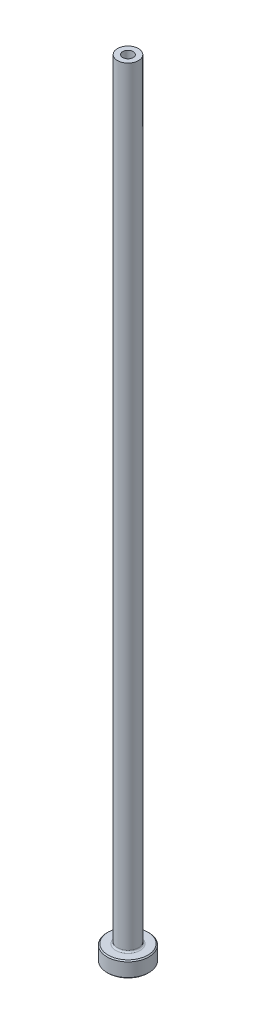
from build123d import *

# Parameters (mm, degrees)
FILLET1_R     = 0.3
CHAMFER1_SIZE = 0.2
CHAMFER3_SIZE = 0.5


with BuildPart() as part:
    # Sketch1 → Revolve1 (revolve)
    with BuildSketch(Plane.XY, mode=Mode.PRIVATE) as revolve1_sk:
        Polygon((-1, 150), (-2, 150), (-2, 3), (-4, 3), (-4, 0), (-1.25, 0), (-1.25, 103), (-1, 115), align=None)
    revolve(revolve1_sk.sketch.rotate(Axis((0, 92.187680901, 0), (0, -1, 0)), 270), axis=Axis((0, 92.187680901, 0), (0, -1, 0)))

    # Fillet1
    fillet1_edges = [part.edges().sort_by_distance(p)[0] for p in [
        (0, 3, -2),
    ]]
    fillet(fillet1_edges, radius=FILLET1_R)

    # Chamfer1
    chamfer1_edges = [part.edges().sort_by_distance(p)[0] for p in [
        (0, 0, -4),
        (0, 3, -4),
    ]]
    chamfer(chamfer1_edges, length=CHAMFER1_SIZE)

    # Chamfer3
    chamfer3_edges = [part.edges().sort_by_distance(p)[0] for p in [
        (0, 0, -1.25),
    ]]
    chamfer(chamfer3_edges, length=CHAMFER3_SIZE)


solid = part.part
